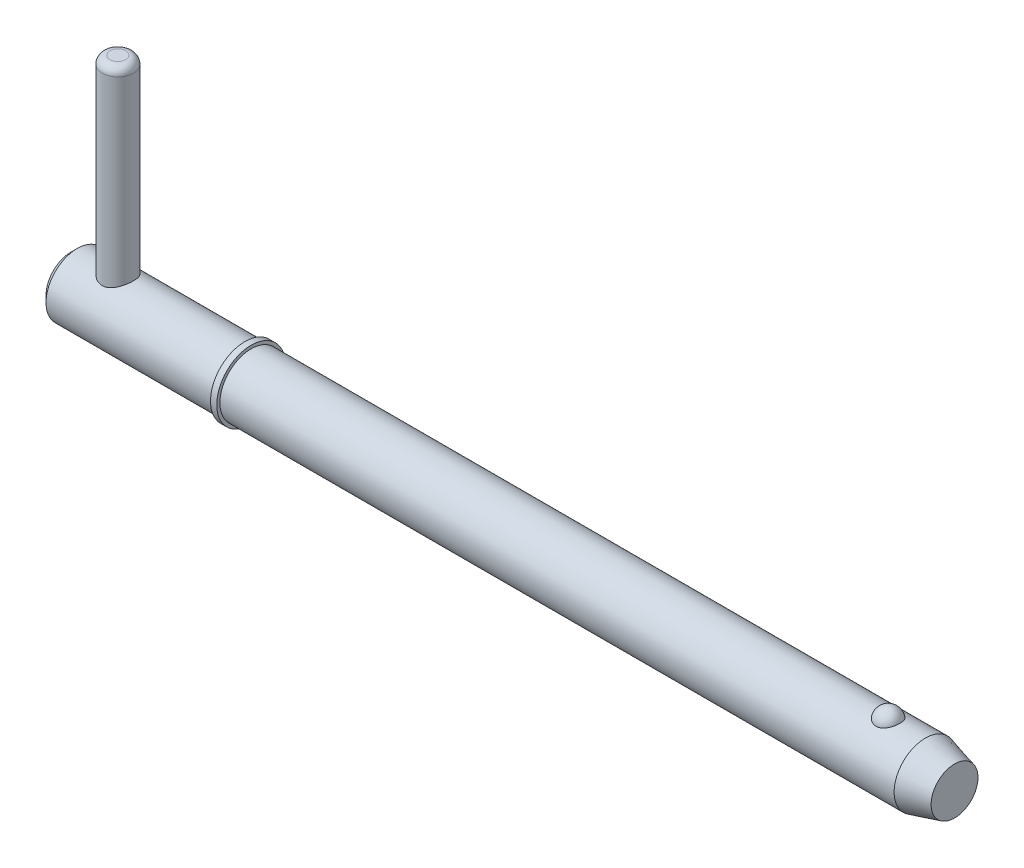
ISO-10303-21;
HEADER;
FILE_DESCRIPTION(('STEP AP214'),'2;1');
FILE_NAME('part.step','',(''),(''),'','','');
FILE_SCHEMA(('AUTOMOTIVE_DESIGN { 1 0 10303 214 1 1 1 1 }'));
ENDSEC;
DATA;
#1=APPLICATION_CONTEXT('core data for automotive mechanical design processes');
#2=APPLICATION_PROTOCOL_DEFINITION('international standard','automotive_design',2000,#1);
#3=PRODUCT_CONTEXT('',#1,'mechanical');
#4=PRODUCT('Part','Part','',(#3));
#5=PRODUCT_RELATED_PRODUCT_CATEGORY('part','',(#4));
#6=PRODUCT_DEFINITION_FORMATION('','',#4);
#7=PRODUCT_DEFINITION_CONTEXT('part definition',#1,'design');
#8=PRODUCT_DEFINITION('design','',#6,#7);
#9=PRODUCT_DEFINITION_SHAPE('','',#8);
#10=(LENGTH_UNIT() NAMED_UNIT(*) SI_UNIT(.MILLI.,.METRE.));
#11=(NAMED_UNIT(*) PLANE_ANGLE_UNIT() SI_UNIT($,.RADIAN.));
#12=(NAMED_UNIT(*) SI_UNIT($,.STERADIAN.) SOLID_ANGLE_UNIT());
#13=UNCERTAINTY_MEASURE_WITH_UNIT(LENGTH_MEASURE(1.E-05),#10,'distance_accuracy_value','');
#14=(GEOMETRIC_REPRESENTATION_CONTEXT(3) GLOBAL_UNCERTAINTY_ASSIGNED_CONTEXT((#13)) GLOBAL_UNIT_ASSIGNED_CONTEXT((#10,
#11,#12)) REPRESENTATION_CONTEXT('',''));
#15=CARTESIAN_POINT('',(0.,0.,0.));
#16=DIRECTION('',(0.,0.,1.));
#17=DIRECTION('',(1.,0.,0.));
#18=AXIS2_PLACEMENT_3D('',#15,#16,#17);
#19=CARTESIAN_POINT('',(4.755,22.225,0.));
#20=DIRECTION('',(0.,-1.,0.));
#21=DIRECTION('',(0.,0.,-1.));
#22=AXIS2_PLACEMENT_3D('',#19,#20,#21);
#23=CYLINDRICAL_SURFACE('',#22,1.585);
#24=CARTESIAN_POINT('',(4.755,-2.3825,0.));
#25=DIRECTION('',(0.,1.,0.));
#26=DIRECTION('',(0.,0.,1.));
#27=AXIS2_PLACEMENT_3D('',#24,#25,#26);
#28=CIRCLE('',#27,1.585);
#29=CARTESIAN_POINT('',(4.755,-2.3825,1.585));
#30=VERTEX_POINT('',#29);
#31=EDGE_CURVE('P0_E25',#30,#30,#28,.T.);
#32=ORIENTED_EDGE('',*,*,#31,.T.);
#33=EDGE_LOOP('',(#32));
#34=FACE_BOUND('',#33,.T.);
#35=CARTESIAN_POINT('',(4.755,21.4325,0.));
#36=DIRECTION('',(0.,1.,0.));
#37=DIRECTION('',(0.,0.,1.));
#38=AXIS2_PLACEMENT_3D('',#35,#36,#37);
#39=CIRCLE('',#38,1.585);
#40=CARTESIAN_POINT('',(4.755,21.4325,1.585));
#41=VERTEX_POINT('',#40);
#42=EDGE_CURVE('P0_E29',#41,#41,#39,.F.);
#43=ORIENTED_EDGE('',*,*,#42,.T.);
#44=EDGE_LOOP('',(#43));
#45=FACE_BOUND('',#44,.T.);
#46=ADVANCED_FACE('P0_F14',(#34,#45),#23,.T.);
#47=CARTESIAN_POINT('',(4.755,22.225,0.));
#48=DIRECTION('',(0.,1.,0.));
#49=DIRECTION('',(0.,0.,1.));
#50=AXIS2_PLACEMENT_3D('',#47,#48,#49);
#51=PLANE('',#50);
#52=CARTESIAN_POINT('',(4.755,22.225,0.));
#53=DIRECTION('',(0.,1.,0.));
#54=DIRECTION('',(0.,0.,1.));
#55=AXIS2_PLACEMENT_3D('',#52,#53,#54);
#56=CIRCLE('',#55,0.7925);
#57=CARTESIAN_POINT('',(4.755,22.225,0.7925));
#58=VERTEX_POINT('',#57);
#59=EDGE_CURVE('P0_E10',#58,#58,#56,.T.);
#60=ORIENTED_EDGE('',*,*,#59,.T.);
#61=EDGE_LOOP('',(#60));
#62=FACE_BOUND('',#61,.T.);
#63=ADVANCED_FACE('P0_F46',(#62),#51,.T.);
#64=CARTESIAN_POINT('',(4.755,-3.175,0.));
#65=DIRECTION('',(0.,1.,0.));
#66=DIRECTION('',(0.,0.,1.));
#67=AXIS2_PLACEMENT_3D('',#64,#65,#66);
#68=PLANE('',#67);
#69=CARTESIAN_POINT('',(4.755,-3.175,0.));
#70=DIRECTION('',(0.,1.,0.));
#71=DIRECTION('',(0.,0.,1.));
#72=AXIS2_PLACEMENT_3D('',#69,#70,#71);
#73=CIRCLE('',#72,0.7925);
#74=CARTESIAN_POINT('',(4.755,-3.175,0.7925));
#75=VERTEX_POINT('',#74);
#76=EDGE_CURVE('P0_E21',#75,#75,#73,.F.);
#77=ORIENTED_EDGE('',*,*,#76,.T.);
#78=EDGE_LOOP('',(#77));
#79=FACE_BOUND('',#78,.T.);
#80=ADVANCED_FACE('P0_F43',(#79),#68,.F.);
#81=CARTESIAN_POINT('',(4.755,-2.3825,0.));
#82=DIRECTION('',(0.,1.,0.));
#83=DIRECTION('',(0.,0.,1.));
#84=AXIS2_PLACEMENT_3D('',#81,#82,#83);
#85=DEGENERATE_TOROIDAL_SURFACE('',#84,0.7925,0.7925,.T.);
#86=ORIENTED_EDGE('',*,*,#76,.F.);
#87=EDGE_LOOP('',(#86));
#88=FACE_BOUND('',#87,.T.);
#89=ORIENTED_EDGE('',*,*,#31,.F.);
#90=EDGE_LOOP('',(#89));
#91=FACE_BOUND('',#90,.T.);
#92=ADVANCED_FACE('P0_F38',(#88,#91),#85,.T.);
#93=CARTESIAN_POINT('',(4.755,21.4325,0.));
#94=DIRECTION('',(0.,1.,0.));
#95=DIRECTION('',(0.,0.,1.));
#96=AXIS2_PLACEMENT_3D('',#93,#94,#95);
#97=DEGENERATE_TOROIDAL_SURFACE('',#96,0.7925,0.7925,.T.);
#98=ORIENTED_EDGE('',*,*,#42,.F.);
#99=EDGE_LOOP('',(#98));
#100=FACE_BOUND('',#99,.T.);
#101=ORIENTED_EDGE('',*,*,#59,.F.);
#102=EDGE_LOOP('',(#101));
#103=FACE_BOUND('',#102,.T.);
#104=ADVANCED_FACE('P0_F16',(#100,#103),#97,.T.);
#105=CLOSED_SHELL('',(#46,#63,#80,#92,#104));
#106=MANIFOLD_SOLID_BREP('P0_B1',#105);
#107=CARTESIAN_POINT('',(0.,0.,0.));
#108=DIRECTION('',(1.,0.,0.));
#109=DIRECTION('',(0.,0.,-1.));
#110=AXIS2_PLACEMENT_3D('',#107,#108,#109);
#111=CYLINDRICAL_SURFACE('',#110,3.175);
#112=CARTESIAN_POINT('',(86.7476846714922,0.,0.));
#113=DIRECTION('',(1.,0.,0.));
#114=DIRECTION('',(0.,0.,-1.));
#115=AXIS2_PLACEMENT_3D('',#112,#113,#114);
#116=CIRCLE('',#115,3.175);
#117=CARTESIAN_POINT('',(86.7476846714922,0.,-3.175));
#118=VERTEX_POINT('',#117);
#119=EDGE_CURVE('P1_E81',#118,#118,#116,.T.);
#120=ORIENTED_EDGE('',*,*,#119,.F.);
#121=EDGE_LOOP('',(#120));
#122=FACE_BOUND('',#121,.T.);
#123=CARTESIAN_POINT('',(18.29,0.,0.));
#124=DIRECTION('',(1.,0.,0.));
#125=DIRECTION('',(0.,0.,-1.));
#126=AXIS2_PLACEMENT_3D('',#123,#124,#125);
#127=CIRCLE('',#126,3.175);
#128=CARTESIAN_POINT('',(18.29,0.,-3.175));
#129=VERTEX_POINT('',#128);
#130=EDGE_CURVE('P1_E85',#129,#129,#127,.T.);
#131=ORIENTED_EDGE('',*,*,#130,.T.);
#132=EDGE_LOOP('',(#131));
#133=FACE_BOUND('',#132,.T.);
#134=CARTESIAN_POINT('',(82.9757276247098,2.92898950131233,1.2254164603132));
#135=CARTESIAN_POINT('',(82.912316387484,2.92899434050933,1.22541146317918));
#136=CARTESIAN_POINT('',(82.8487979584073,2.93112688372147,1.2203464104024));
#137=CARTESIAN_POINT('',(82.7235306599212,2.93942752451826,1.20020949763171));
#138=CARTESIAN_POINT('',(82.6617869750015,2.9456063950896,1.1851109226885));
#139=CARTESIAN_POINT('',(82.5420651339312,2.96127115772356,1.14540352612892));
#140=CARTESIAN_POINT('',(82.4840775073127,2.97074831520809,1.12081980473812));
#141=CARTESIAN_POINT('',(82.3731943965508,2.99197584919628,1.06285154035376));
#142=CARTESIAN_POINT('',(82.3202966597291,3.0037252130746,1.02947091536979));
#143=CARTESIAN_POINT('',(82.2192688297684,3.02865714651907,0.953674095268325));
#144=CARTESIAN_POINT('',(82.171324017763,3.04187163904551,0.911021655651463));
#145=CARTESIAN_POINT('',(82.0830360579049,3.06808741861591,0.818400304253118));
#146=CARTESIAN_POINT('',(82.0426952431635,3.08108863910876,0.768429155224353));
#147=CARTESIAN_POINT('',(81.9688039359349,3.10614903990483,0.660064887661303));
#148=CARTESIAN_POINT('',(81.9356330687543,3.11814104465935,0.601396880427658));
#149=CARTESIAN_POINT('',(81.8791190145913,3.13926931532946,0.479026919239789));
#150=CARTESIAN_POINT('',(81.8557764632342,3.14840539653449,0.415324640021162));
#151=CARTESIAN_POINT('',(81.8191785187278,3.16298160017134,0.283885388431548));
#152=CARTESIAN_POINT('',(81.8060407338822,3.16837855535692,0.216110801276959));
#153=CARTESIAN_POINT('',(81.7905676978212,3.17475386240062,0.0791367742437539));
#154=CARTESIAN_POINT('',(81.788232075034,3.17573236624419,0.00993738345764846));
#155=CARTESIAN_POINT('',(81.794388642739,3.17318075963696,-0.127420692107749));
#156=CARTESIAN_POINT('',(81.8028073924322,3.16968122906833,-0.19558325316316));
#157=CARTESIAN_POINT('',(81.8301752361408,3.1585790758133,-0.329413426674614));
#158=CARTESIAN_POINT('',(81.8491245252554,3.15097637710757,-0.395080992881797));
#159=CARTESIAN_POINT('',(81.8972057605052,3.13242485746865,-0.5221806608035));
#160=CARTESIAN_POINT('',(81.9263524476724,3.12147119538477,-0.583606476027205));
#161=CARTESIAN_POINT('',(81.9942352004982,3.09734973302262,-0.700436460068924));
#162=CARTESIAN_POINT('',(82.032972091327,3.08418174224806,-0.755840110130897));
#163=CARTESIAN_POINT('',(82.1194771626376,3.05694884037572,-0.859404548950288));
#164=CARTESIAN_POINT('',(82.1672961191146,3.04287919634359,-0.907521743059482));
#165=CARTESIAN_POINT('',(82.2707353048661,3.01548927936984,-0.994758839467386));
#166=CARTESIAN_POINT('',(82.3263549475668,3.0021689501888,-1.03387941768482));
#167=CARTESIAN_POINT('',(82.4428093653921,2.97810316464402,-1.10126594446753));
#168=CARTESIAN_POINT('',(82.5035182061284,2.96731170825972,-1.12973256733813));
#169=CARTESIAN_POINT('',(82.6293712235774,2.94928934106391,-1.17598467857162));
#170=CARTESIAN_POINT('',(82.6945137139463,2.94205708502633,-1.19377420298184));
#171=CARTESIAN_POINT('',(82.8238562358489,2.93233065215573,-1.21746387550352));
#172=CARTESIAN_POINT('',(82.8879385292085,2.92961621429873,-1.22391763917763));
#173=CARTESIAN_POINT('',(83.0163375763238,2.92855752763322,-1.22644976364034));
#174=CARTESIAN_POINT('',(83.0806542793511,2.93021238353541,-1.22253024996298));
#175=CARTESIAN_POINT('',(83.2055239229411,2.9375685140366,-1.20474140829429));
#176=CARTESIAN_POINT('',(83.266131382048,2.94313790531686,-1.19119621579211));
#177=CARTESIAN_POINT('',(83.3841106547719,2.95756226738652,-1.15491492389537));
#178=CARTESIAN_POINT('',(83.4414822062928,2.96641750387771,-1.13217808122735));
#179=CARTESIAN_POINT('',(83.5527699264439,2.98669918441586,-1.07755083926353));
#180=CARTESIAN_POINT('',(83.6065845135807,2.9981771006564,-1.0454730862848));
#181=CARTESIAN_POINT('',(83.7081473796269,3.02240235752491,-0.97322030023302));
#182=CARTESIAN_POINT('',(83.7558942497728,3.03514999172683,-0.933043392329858));
#183=CARTESIAN_POINT('',(83.8465817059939,3.06131230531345,-0.843372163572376));
#184=CARTESIAN_POINT('',(83.8891588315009,3.07472822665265,-0.793510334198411));
#185=CARTESIAN_POINT('',(83.9656765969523,3.10021106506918,-0.687241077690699));
#186=CARTESIAN_POINT('',(83.9996156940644,3.1122777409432,-0.630832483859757));
#187=CARTESIAN_POINT('',(84.0591209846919,3.134208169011,-0.51105938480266));
#188=CARTESIAN_POINT('',(84.0843892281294,3.14399040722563,-0.447531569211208));
#189=CARTESIAN_POINT('',(84.1245117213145,3.15983820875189,-0.31682749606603));
#190=CARTESIAN_POINT('',(84.1393659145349,3.16590375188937,-0.249651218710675));
#191=CARTESIAN_POINT('',(84.158358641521,3.17370076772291,-0.113549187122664));
#192=CARTESIAN_POINT('',(84.1624966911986,3.17543204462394,-0.0446233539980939));
#193=CARTESIAN_POINT('',(84.1599697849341,3.17438372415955,0.0929938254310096));
#194=CARTESIAN_POINT('',(84.1533050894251,3.17160423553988,0.16168517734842));
#195=CARTESIAN_POINT('',(84.1293754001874,3.1618438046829,0.296502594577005));
#196=CARTESIAN_POINT('',(84.1121674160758,3.15488546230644,0.362640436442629));
#197=CARTESIAN_POINT('',(84.067547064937,3.13748892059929,0.490896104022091));
#198=CARTESIAN_POINT('',(84.0401339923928,3.12705048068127,0.553013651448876));
#199=CARTESIAN_POINT('',(83.9754626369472,3.10369139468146,0.671876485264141));
#200=CARTESIAN_POINT('',(83.9381467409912,3.0907563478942,0.728587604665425));
#201=CARTESIAN_POINT('',(83.8545246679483,3.06381731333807,0.834653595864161));
#202=CARTESIAN_POINT('',(83.8082189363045,3.04981337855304,0.884008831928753));
#203=CARTESIAN_POINT('',(83.707718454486,3.02230423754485,0.973916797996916));
#204=CARTESIAN_POINT('',(83.653535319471,3.00879833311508,1.01448227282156));
#205=CARTESIAN_POINT('',(83.5385299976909,2.98383625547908,1.0857155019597));
#206=CARTESIAN_POINT('',(83.4777053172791,2.9723808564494,1.11637952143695));
#207=CARTESIAN_POINT('',(83.3533690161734,2.95329063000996,1.16592590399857));
#208=CARTESIAN_POINT('',(83.2900230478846,2.9455373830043,1.18517901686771));
#209=CARTESIAN_POINT('',(83.1607664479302,2.9342556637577,1.21284802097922));
#210=CARTESIAN_POINT('',(83.0948641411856,2.93071450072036,1.2212964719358));
#211=CARTESIAN_POINT('',(83.011116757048,2.9291525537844,1.22502505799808));
#212=CARTESIAN_POINT('',(82.9934263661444,2.92898815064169,1.22541785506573));
#213=CARTESIAN_POINT('',(82.9757276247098,2.92898950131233,1.2254164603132));
#214=B_SPLINE_CURVE_WITH_KNOTS('',3,(#134,#135,#136,#137,#138,#139,#140,#141,#142,#143,#144,
#145,#146,#147,#148,#149,#150,#151,#152,#153,#154,#155,#156,#157,#158,#159,#160,#161,#162,#163,
#164,#165,#166,#167,#168,#169,#170,#171,#172,#173,#174,#175,#176,#177,#178,#179,#180,#181,#182,
#183,#184,#185,#186,#187,#188,#189,#190,#191,#192,#193,#194,#195,#196,#197,#198,#199,#200,#201,
#202,#203,#204,#205,#206,#207,#208,#209,#210,#211,#212,#213),.UNSPECIFIED.,.T.,.F.,(4,2,2,2,2,2,
2,2,2,2,2,2,2,2,2,2,2,2,2,2,2,2,2,2,2,2,2,2,2,2,2,2,2,2,2,2,2,2,2,4),(0.,0.190186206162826,
0.380880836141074,0.571074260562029,0.761183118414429,0.956866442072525,1.15260970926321,
1.3570177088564,1.56143892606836,1.76818248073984,1.97491892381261,2.18025109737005,
2.38558707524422,2.59122111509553,2.79687285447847,3.00371012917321,3.2105318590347,
3.41323429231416,3.61586005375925,3.80828192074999,4.00066436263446,4.18685798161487,
4.37306665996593,4.56330302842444,4.75358348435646,4.95345287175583,5.15335793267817,
5.35957003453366,5.56578325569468,5.7720057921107,5.97822335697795,6.183335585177,
6.38846199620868,6.59480900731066,6.80114579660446,7.00718137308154,7.21329457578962,
7.41228022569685,7.61066481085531,7.66374777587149),.UNSPECIFIED.);
#215=CARTESIAN_POINT('',(82.9757276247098,2.92898950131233,1.2254164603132));
#216=VERTEX_POINT('',#215);
#217=EDGE_CURVE('P1_E35',#216,#216,#214,.T.);
#218=ORIENTED_EDGE('',*,*,#217,.T.);
#219=EDGE_LOOP('',(#218));
#220=FACE_BOUND('',#219,.T.);
#221=ADVANCED_FACE('P1_F13',(#122,#133,#220),#111,.T.);
#222=CARTESIAN_POINT('',(0.,0.,0.));
#223=DIRECTION('',(-1.,0.,0.));
#224=DIRECTION('',(0.,0.,1.));
#225=AXIS2_PLACEMENT_3D('',#222,#223,#224);
#226=PLANE('',#225);
#227=CARTESIAN_POINT('',(0.,0.,0.));
#228=DIRECTION('',(1.,0.,0.));
#229=DIRECTION('',(0.,0.,-1.));
#230=AXIS2_PLACEMENT_3D('',#227,#228,#229);
#231=CIRCLE('',#230,2.54);
#232=CARTESIAN_POINT('',(0.,0.,-2.54));
#233=VERTEX_POINT('',#232);
#234=EDGE_CURVE('P1_E9',#233,#233,#231,.T.);
#235=ORIENTED_EDGE('',*,*,#234,.F.);
#236=EDGE_LOOP('',(#235));
#237=FACE_BOUND('',#236,.T.);
#238=ADVANCED_FACE('P1_F15',(#237),#226,.T.);
#239=CARTESIAN_POINT('',(0.634999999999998,0.,0.));
#240=DIRECTION('',(1.,0.,0.));
#241=DIRECTION('',(0.,0.,-1.));
#242=AXIS2_PLACEMENT_3D('',#239,#240,#241);
#243=CONICAL_SURFACE('',#242,3.175,0.78539816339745);
#244=ORIENTED_EDGE('',*,*,#234,.T.);
#245=EDGE_LOOP('',(#244));
#246=FACE_BOUND('',#245,.T.);
#247=CARTESIAN_POINT('',(0.634999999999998,0.,0.));
#248=DIRECTION('',(1.,0.,0.));
#249=DIRECTION('',(0.,0.,-1.));
#250=AXIS2_PLACEMENT_3D('',#247,#248,#249);
#251=CIRCLE('',#250,3.175);
#252=CARTESIAN_POINT('',(0.634999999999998,0.,-3.175));
#253=VERTEX_POINT('',#252);
#254=EDGE_CURVE('P1_E26',#253,#253,#251,.T.);
#255=ORIENTED_EDGE('',*,*,#254,.F.);
#256=EDGE_LOOP('',(#255));
#257=FACE_BOUND('',#256,.T.);
#258=ADVANCED_FACE('P1_F77',(#246,#257),#243,.T.);
#259=CARTESIAN_POINT('',(0.,0.,0.));
#260=DIRECTION('',(1.,0.,0.));
#261=DIRECTION('',(0.,0.,-1.));
#262=AXIS2_PLACEMENT_3D('',#259,#260,#261);
#263=CYLINDRICAL_SURFACE('',#262,3.175);
#264=CARTESIAN_POINT('',(4.755,-2.75107251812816,1.585));
#265=CARTESIAN_POINT('',(4.67238891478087,-2.7510796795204,1.58499425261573));
#266=CARTESIAN_POINT('',(4.58967306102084,-2.75485010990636,1.57849830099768));
#267=CARTESIAN_POINT('',(4.42677850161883,-2.76938647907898,1.55284486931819));
#268=CARTESIAN_POINT('',(4.34660551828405,-2.78016716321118,1.53366069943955));
#269=CARTESIAN_POINT('',(4.19146029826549,-2.80716278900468,1.48366329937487));
#270=CARTESIAN_POINT('',(4.11646293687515,-2.8233488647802,1.45291173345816));
#271=CARTESIAN_POINT('',(3.97271079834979,-2.85928672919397,1.38084067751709));
#272=CARTESIAN_POINT('',(3.90395634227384,-2.87903870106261,1.33952064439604));
#273=CARTESIAN_POINT('',(3.76839976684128,-2.921867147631,1.24350234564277));
#274=CARTESIAN_POINT('',(3.702222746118,-2.94508343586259,1.18798355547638));
#275=CARTESIAN_POINT('',(3.5796334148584,-2.99109588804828,1.06685014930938));
#276=CARTESIAN_POINT('',(3.52322596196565,-3.01389183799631,1.00123054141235));
#277=CARTESIAN_POINT('',(3.41807024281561,-3.05832598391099,0.856373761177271));
#278=CARTESIAN_POINT('',(3.37009053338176,-3.07978367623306,0.776518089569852));
#279=CARTESIAN_POINT('',(3.28853137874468,-3.11730894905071,0.608596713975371));
#280=CARTESIAN_POINT('',(3.25494287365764,-3.1333799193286,0.520536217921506));
#281=CARTESIAN_POINT('',(3.20559401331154,-3.15731341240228,0.345327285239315));
#282=CARTESIAN_POINT('',(3.18873760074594,-3.16567752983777,0.258557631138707));
#283=CARTESIAN_POINT('',(3.16972238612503,-3.17512718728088,0.0830496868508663));
#284=CARTESIAN_POINT('',(3.16755472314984,-3.17621711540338,-0.00568738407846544));
#285=CARTESIAN_POINT('',(3.1775542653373,-3.17123385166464,-0.174372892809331));
#286=CARTESIAN_POINT('',(3.18849502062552,-3.16577346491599,-0.254416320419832));
#287=CARTESIAN_POINT('',(3.22220680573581,-3.14922844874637,-0.411354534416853));
#288=CARTESIAN_POINT('',(3.2449787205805,-3.13814339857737,-0.488249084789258));
#289=CARTESIAN_POINT('',(3.30185558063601,-3.111172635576,-0.638050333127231));
#290=CARTESIAN_POINT('',(3.33611332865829,-3.09522247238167,-0.710886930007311));
#291=CARTESIAN_POINT('',(3.41477890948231,-3.05996035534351,-0.849953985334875));
#292=CARTESIAN_POINT('',(3.45919037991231,-3.04064719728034,-0.916182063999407));
#293=CARTESIAN_POINT('',(3.5617148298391,-2.99832415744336,-1.04681642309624));
#294=CARTESIAN_POINT('',(3.62072497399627,-2.97513741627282,-1.11046186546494));
#295=CARTESIAN_POINT('',(3.7483697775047,-2.92885066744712,-1.22736291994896));
#296=CARTESIAN_POINT('',(3.81701173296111,-2.90575073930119,-1.2806105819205));
#297=CARTESIAN_POINT('',(3.96727993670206,-2.86067370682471,-1.37849835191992));
#298=CARTESIAN_POINT('',(4.04945242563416,-2.83885964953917,-1.42238246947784));
#299=CARTESIAN_POINT('',(4.2213558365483,-2.80110454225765,-1.49537418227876));
#300=CARTESIAN_POINT('',(4.3110787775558,-2.78515738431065,-1.52449715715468));
#301=CARTESIAN_POINT('',(4.48806324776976,-2.76271292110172,-1.56478065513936));
#302=CARTESIAN_POINT('',(4.57495732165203,-2.75556745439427,-1.57718067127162));
#303=CARTESIAN_POINT('',(4.74985771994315,-2.74969306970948,-1.58740564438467));
#304=CARTESIAN_POINT('',(4.8378632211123,-2.75095824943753,-1.58524082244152));
#305=CARTESIAN_POINT('',(5.00227282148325,-2.76107477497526,-1.56753530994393));
#306=CARTESIAN_POINT('',(5.07889680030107,-2.76908515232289,-1.55347662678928));
#307=CARTESIAN_POINT('',(5.22855309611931,-2.79054849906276,-1.51458035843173));
#308=CARTESIAN_POINT('',(5.30158424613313,-2.80400322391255,-1.489739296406));
#309=CARTESIAN_POINT('',(5.44583114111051,-2.83556995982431,-1.42877335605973));
#310=CARTESIAN_POINT('',(5.51680600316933,-2.85386886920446,-1.39217900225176));
#311=CARTESIAN_POINT('',(5.6520174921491,-2.89289503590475,-1.30915485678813));
#312=CARTESIAN_POINT('',(5.71625063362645,-2.91362353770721,-1.26272001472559));
#313=CARTESIAN_POINT('',(5.8445938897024,-2.95830220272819,-1.15451693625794));
#314=CARTESIAN_POINT('',(5.90767560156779,-2.98233004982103,-1.09155543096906));
#315=CARTESIAN_POINT('',(6.0226995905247,-3.02864458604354,-0.955560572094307));
#316=CARTESIAN_POINT('',(6.07463814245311,-3.05093069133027,-0.882523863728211));
#317=CARTESIAN_POINT('',(6.16704288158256,-3.09200671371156,-0.725836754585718));
#318=CARTESIAN_POINT('',(6.20717458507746,-3.11069030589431,-0.64195924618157));
#319=CARTESIAN_POINT('',(6.27235859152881,-3.1416474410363,-0.467442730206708));
#320=CARTESIAN_POINT('',(6.29742409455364,-3.15392659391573,-0.376809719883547));
#321=CARTESIAN_POINT('',(6.32960989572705,-3.16979844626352,-0.200314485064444));
#322=CARTESIAN_POINT('',(6.33816324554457,-3.17408359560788,-0.114775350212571));
#323=CARTESIAN_POINT('',(6.34130309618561,-3.17565001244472,0.0566108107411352));
#324=CARTESIAN_POINT('',(6.33589445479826,-3.17293371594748,0.142457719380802));
#325=CARTESIAN_POINT('',(6.31221457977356,-3.16120608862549,0.306097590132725));
#326=CARTESIAN_POINT('',(6.2948097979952,-3.15261910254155,0.38404960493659));
#327=CARTESIAN_POINT('',(6.24879775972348,-3.13040364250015,0.535801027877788));
#328=CARTESIAN_POINT('',(6.22018889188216,-3.11677444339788,0.609599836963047));
#329=CARTESIAN_POINT('',(6.15130303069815,-3.08497808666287,0.754502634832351));
#330=CARTESIAN_POINT('',(6.11057850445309,-3.0666414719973,0.82535556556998));
#331=CARTESIAN_POINT('',(6.01917980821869,-3.02735012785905,0.95951596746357));
#332=CARTESIAN_POINT('',(5.96850106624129,-3.00639419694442,1.02281994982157));
#333=CARTESIAN_POINT('',(5.8528006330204,-2.96149402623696,1.1467073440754));
#334=CARTESIAN_POINT('',(5.78685463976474,-2.93745961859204,1.20639723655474));
#335=CARTESIAN_POINT('',(5.64552278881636,-2.89084502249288,1.31419099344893));
#336=CARTESIAN_POINT('',(5.57012871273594,-2.8682661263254,1.36228466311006));
#337=CARTESIAN_POINT('',(5.40892145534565,-2.82661780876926,1.44677201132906));
#338=CARTESIAN_POINT('',(5.32285703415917,-2.80767948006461,1.48275497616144));
#339=CARTESIAN_POINT('',(5.14469010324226,-2.77716572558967,1.53916557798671));
#340=CARTESIAN_POINT('',(5.05260892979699,-2.76556569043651,1.55964525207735));
#341=CARTESIAN_POINT('',(4.92544162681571,-2.75613775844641,1.57618070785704));
#342=CARTESIAN_POINT('',(4.89147210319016,-2.75424493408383,1.57948285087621));
#343=CARTESIAN_POINT('',(4.82334103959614,-2.75171079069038,1.58389375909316));
#344=CARTESIAN_POINT('',(4.78917948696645,-2.75106955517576,1.58500237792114));
#345=CARTESIAN_POINT('',(4.755,-2.75107251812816,1.585));
#346=B_SPLINE_CURVE_WITH_KNOTS('',3,(#264,#265,#266,#267,#268,#269,#270,#271,#272,#273,#274,
#275,#276,#277,#278,#279,#280,#281,#282,#283,#284,#285,#286,#287,#288,#289,#290,#291,#292,#293,
#294,#295,#296,#297,#298,#299,#300,#301,#302,#303,#304,#305,#306,#307,#308,#309,#310,#311,#312,
#313,#314,#315,#316,#317,#318,#319,#320,#321,#322,#323,#324,#325,#326,#327,#328,#329,#330,#331,
#332,#333,#334,#335,#336,#337,#338,#339,#340,#341,#342,#343,#344,#345),.UNSPECIFIED.,.T.,.F.,(4,
2,2,2,2,2,2,2,2,2,2,2,2,2,2,2,2,2,2,2,2,2,2,2,2,2,2,2,2,2,2,2,2,2,2,2,2,2,2,2,4),(0.,
0.247689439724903,0.495901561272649,0.742808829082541,0.989728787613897,1.25694656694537,
1.52429683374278,1.80959781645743,2.0947189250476,2.35960564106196,2.62433255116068,
2.86610932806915,3.1079041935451,3.35305262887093,3.59828902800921,3.86665310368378,
4.13522157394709,4.4207514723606,4.70598326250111,4.9686344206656,5.23110127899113,
5.46499114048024,5.69895647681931,5.94376186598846,6.1886932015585,6.46438263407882,
6.74016408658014,7.0231370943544,7.30586181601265,7.5626977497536,7.81944433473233,
8.05935987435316,8.29930993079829,8.54954401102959,8.79989329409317,9.07508848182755,
9.35052473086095,9.63453318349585,9.91758407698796,10.0200561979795,10.1225351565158),.UNSPECIFIED.);
#347=CARTESIAN_POINT('',(4.755,-2.75107251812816,1.585));
#348=VERTEX_POINT('',#347);
#349=EDGE_CURVE('P1_E17',#348,#348,#346,.T.);
#350=ORIENTED_EDGE('',*,*,#349,.F.);
#351=EDGE_LOOP('',(#350));
#352=FACE_BOUND('',#351,.T.);
#353=CARTESIAN_POINT('',(4.755,2.75107251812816,1.585));
#354=CARTESIAN_POINT('',(4.83761108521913,2.7510796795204,1.58499425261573));
#355=CARTESIAN_POINT('',(4.92032693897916,2.75485010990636,1.57849830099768));
#356=CARTESIAN_POINT('',(5.08322149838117,2.76938647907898,1.55284486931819));
#357=CARTESIAN_POINT('',(5.16339448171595,2.78016716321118,1.53366069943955));
#358=CARTESIAN_POINT('',(5.31853970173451,2.80716278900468,1.48366329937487));
#359=CARTESIAN_POINT('',(5.39353706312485,2.8233488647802,1.45291173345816));
#360=CARTESIAN_POINT('',(5.53728920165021,2.85928672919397,1.38084067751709));
#361=CARTESIAN_POINT('',(5.60604365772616,2.87903870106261,1.33952064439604));
#362=CARTESIAN_POINT('',(5.74160023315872,2.921867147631,1.24350234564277));
#363=CARTESIAN_POINT('',(5.807777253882,2.94508343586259,1.18798355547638));
#364=CARTESIAN_POINT('',(5.9303665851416,2.99109588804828,1.06685014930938));
#365=CARTESIAN_POINT('',(5.98677403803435,3.01389183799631,1.00123054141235));
#366=CARTESIAN_POINT('',(6.09192975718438,3.05832598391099,0.85637376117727));
#367=CARTESIAN_POINT('',(6.13990946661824,3.07978367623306,0.776518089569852));
#368=CARTESIAN_POINT('',(6.22146862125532,3.11730894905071,0.608596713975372));
#369=CARTESIAN_POINT('',(6.25505712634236,3.1333799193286,0.520536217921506));
#370=CARTESIAN_POINT('',(6.30440598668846,3.15731341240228,0.345327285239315));
#371=CARTESIAN_POINT('',(6.32126239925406,3.16567752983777,0.258557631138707));
#372=CARTESIAN_POINT('',(6.34027761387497,3.17512718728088,0.0830496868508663));
#373=CARTESIAN_POINT('',(6.34244527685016,3.17621711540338,-0.00568738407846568));
#374=CARTESIAN_POINT('',(6.3324457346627,3.17123385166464,-0.174372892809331));
#375=CARTESIAN_POINT('',(6.32150497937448,3.16577346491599,-0.254416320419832));
#376=CARTESIAN_POINT('',(6.28779319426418,3.14922844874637,-0.411354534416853));
#377=CARTESIAN_POINT('',(6.2650212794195,3.13814339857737,-0.488249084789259));
#378=CARTESIAN_POINT('',(6.20814441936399,3.111172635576,-0.638050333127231));
#379=CARTESIAN_POINT('',(6.17388667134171,3.09522247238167,-0.710886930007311));
#380=CARTESIAN_POINT('',(6.09522109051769,3.05996035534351,-0.849953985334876));
#381=CARTESIAN_POINT('',(6.05080962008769,3.04064719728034,-0.916182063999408));
#382=CARTESIAN_POINT('',(5.9482851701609,2.99832415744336,-1.04681642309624));
#383=CARTESIAN_POINT('',(5.88927502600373,2.97513741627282,-1.11046186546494));
#384=CARTESIAN_POINT('',(5.7616302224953,2.92885066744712,-1.22736291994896));
#385=CARTESIAN_POINT('',(5.69298826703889,2.90575073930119,-1.2806105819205));
#386=CARTESIAN_POINT('',(5.54272006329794,2.86067370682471,-1.37849835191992));
#387=CARTESIAN_POINT('',(5.46054757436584,2.83885964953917,-1.42238246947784));
#388=CARTESIAN_POINT('',(5.2886441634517,2.80110454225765,-1.49537418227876));
#389=CARTESIAN_POINT('',(5.19892122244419,2.78515738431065,-1.52449715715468));
#390=CARTESIAN_POINT('',(5.02193675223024,2.76271292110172,-1.56478065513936));
#391=CARTESIAN_POINT('',(4.93504267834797,2.75556745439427,-1.57718067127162));
#392=CARTESIAN_POINT('',(4.76014228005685,2.74969306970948,-1.58740564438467));
#393=CARTESIAN_POINT('',(4.6721367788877,2.75095824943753,-1.58524082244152));
#394=CARTESIAN_POINT('',(4.50772717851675,2.76107477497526,-1.56753530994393));
#395=CARTESIAN_POINT('',(4.43110319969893,2.76908515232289,-1.55347662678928));
#396=CARTESIAN_POINT('',(4.28144690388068,2.79054849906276,-1.51458035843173));
#397=CARTESIAN_POINT('',(4.20841575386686,2.80400322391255,-1.489739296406));
#398=CARTESIAN_POINT('',(4.06416885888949,2.83556995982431,-1.42877335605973));
#399=CARTESIAN_POINT('',(3.99319399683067,2.85386886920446,-1.39217900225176));
#400=CARTESIAN_POINT('',(3.8579825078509,2.89289503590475,-1.30915485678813));
#401=CARTESIAN_POINT('',(3.79374936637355,2.91362353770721,-1.26272001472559));
#402=CARTESIAN_POINT('',(3.6654061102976,2.95830220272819,-1.15451693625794));
#403=CARTESIAN_POINT('',(3.60232439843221,2.98233004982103,-1.09155543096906));
#404=CARTESIAN_POINT('',(3.4873004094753,3.02864458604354,-0.955560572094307));
#405=CARTESIAN_POINT('',(3.43536185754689,3.05093069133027,-0.88252386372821));
#406=CARTESIAN_POINT('',(3.34295711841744,3.09200671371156,-0.725836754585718));
#407=CARTESIAN_POINT('',(3.30282541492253,3.11069030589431,-0.64195924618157));
#408=CARTESIAN_POINT('',(3.23764140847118,3.14164744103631,-0.467442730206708));
#409=CARTESIAN_POINT('',(3.21257590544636,3.15392659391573,-0.376809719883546));
#410=CARTESIAN_POINT('',(3.18039010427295,3.16979844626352,-0.200314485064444));
#411=CARTESIAN_POINT('',(3.17183675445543,3.17408359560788,-0.114775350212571));
#412=CARTESIAN_POINT('',(3.16869690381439,3.17565001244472,0.0566108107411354));
#413=CARTESIAN_POINT('',(3.17410554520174,3.17293371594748,0.142457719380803));
#414=CARTESIAN_POINT('',(3.19778542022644,3.16120608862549,0.306097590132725));
#415=CARTESIAN_POINT('',(3.2151902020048,3.15261910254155,0.384049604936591));
#416=CARTESIAN_POINT('',(3.26120224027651,3.13040364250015,0.535801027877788));
#417=CARTESIAN_POINT('',(3.28981110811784,3.11677444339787,0.609599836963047));
#418=CARTESIAN_POINT('',(3.35869696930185,3.08497808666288,0.754502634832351));
#419=CARTESIAN_POINT('',(3.39942149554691,3.0666414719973,0.82535556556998));
#420=CARTESIAN_POINT('',(3.49082019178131,3.02735012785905,0.95951596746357));
#421=CARTESIAN_POINT('',(3.54149893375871,3.00639419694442,1.02281994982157));
#422=CARTESIAN_POINT('',(3.6571993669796,2.96149402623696,1.1467073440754));
#423=CARTESIAN_POINT('',(3.72314536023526,2.93745961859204,1.20639723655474));
#424=CARTESIAN_POINT('',(3.86447721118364,2.89084502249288,1.31419099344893));
#425=CARTESIAN_POINT('',(3.93987128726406,2.8682661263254,1.36228466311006));
#426=CARTESIAN_POINT('',(4.10107854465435,2.82661780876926,1.44677201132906));
#427=CARTESIAN_POINT('',(4.18714296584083,2.80767948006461,1.48275497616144));
#428=CARTESIAN_POINT('',(4.36530989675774,2.77716572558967,1.53916557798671));
#429=CARTESIAN_POINT('',(4.45739107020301,2.76556569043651,1.55964525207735));
#430=CARTESIAN_POINT('',(4.58455837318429,2.75613775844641,1.57618070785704));
#431=CARTESIAN_POINT('',(4.61852789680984,2.75424493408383,1.57948285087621));
#432=CARTESIAN_POINT('',(4.68665896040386,2.75171079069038,1.58389375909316));
#433=CARTESIAN_POINT('',(4.72082051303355,2.75106955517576,1.58500237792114));
#434=CARTESIAN_POINT('',(4.755,2.75107251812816,1.585));
#435=B_SPLINE_CURVE_WITH_KNOTS('',3,(#353,#354,#355,#356,#357,#358,#359,#360,#361,#362,#363,
#364,#365,#366,#367,#368,#369,#370,#371,#372,#373,#374,#375,#376,#377,#378,#379,#380,#381,#382,
#383,#384,#385,#386,#387,#388,#389,#390,#391,#392,#393,#394,#395,#396,#397,#398,#399,#400,#401,
#402,#403,#404,#405,#406,#407,#408,#409,#410,#411,#412,#413,#414,#415,#416,#417,#418,#419,#420,
#421,#422,#423,#424,#425,#426,#427,#428,#429,#430,#431,#432,#433,#434),.UNSPECIFIED.,.T.,.F.,(4,
2,2,2,2,2,2,2,2,2,2,2,2,2,2,2,2,2,2,2,2,2,2,2,2,2,2,2,2,2,2,2,2,2,2,2,2,2,2,2,4),(0.,
0.247689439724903,0.495901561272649,0.742808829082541,0.989728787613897,1.25694656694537,
1.52429683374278,1.80959781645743,2.0947189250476,2.35960564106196,2.62433255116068,
2.86610932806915,3.1079041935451,3.35305262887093,3.59828902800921,3.86665310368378,
4.13522157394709,4.4207514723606,4.70598326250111,4.9686344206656,5.23110127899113,
5.46499114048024,5.69895647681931,5.94376186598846,6.1886932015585,6.46438263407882,
6.74016408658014,7.0231370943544,7.30586181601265,7.5626977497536,7.81944433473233,
8.05935987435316,8.29930993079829,8.54954401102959,8.79989329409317,9.07508848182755,
9.35052473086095,9.63453318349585,9.91758407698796,10.0200561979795,10.1225351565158),.UNSPECIFIED.);
#436=CARTESIAN_POINT('',(4.755,2.75107251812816,1.585));
#437=VERTEX_POINT('',#436);
#438=EDGE_CURVE('P1_E43',#437,#437,#435,.T.);
#439=ORIENTED_EDGE('',*,*,#438,.F.);
#440=EDGE_LOOP('',(#439));
#441=FACE_BOUND('',#440,.T.);
#442=ORIENTED_EDGE('',*,*,#254,.T.);
#443=EDGE_LOOP('',(#442));
#444=FACE_BOUND('',#443,.T.);
#445=CARTESIAN_POINT('',(17.655,0.,0.));
#446=DIRECTION('',(1.,0.,0.));
#447=DIRECTION('',(0.,0.,-1.));
#448=AXIS2_PLACEMENT_3D('',#445,#446,#447);
#449=CIRCLE('',#448,3.175);
#450=CARTESIAN_POINT('',(17.655,0.,-3.175));
#451=VERTEX_POINT('',#450);
#452=EDGE_CURVE('P1_E31',#451,#451,#449,.T.);
#453=ORIENTED_EDGE('',*,*,#452,.F.);
#454=EDGE_LOOP('',(#453));
#455=FACE_BOUND('',#454,.T.);
#456=ADVANCED_FACE('P1_F103',(#352,#441,#444,#455),#263,.T.);
#457=CARTESIAN_POINT('',(17.655,3.175,0.));
#458=DIRECTION('',(-1.,0.,0.));
#459=DIRECTION('',(0.,0.,1.));
#460=AXIS2_PLACEMENT_3D('',#457,#458,#459);
#461=PLANE('',#460);
#462=ORIENTED_EDGE('',*,*,#452,.T.);
#463=EDGE_LOOP('',(#462));
#464=FACE_BOUND('',#463,.T.);
#465=CARTESIAN_POINT('',(17.655,0.,0.));
#466=DIRECTION('',(1.,0.,0.));
#467=DIRECTION('',(0.,0.,-1.));
#468=AXIS2_PLACEMENT_3D('',#465,#466,#467);
#469=CIRCLE('',#468,3.4925);
#470=CARTESIAN_POINT('',(17.655,0.,-3.4925));
#471=VERTEX_POINT('',#470);
#472=EDGE_CURVE('P1_E91',#471,#471,#469,.T.);
#473=ORIENTED_EDGE('',*,*,#472,.F.);
#474=EDGE_LOOP('',(#473));
#475=FACE_BOUND('',#474,.T.);
#476=ADVANCED_FACE('P1_F100',(#464,#475),#461,.T.);
#477=CARTESIAN_POINT('',(0.,0.,0.));
#478=DIRECTION('',(1.,0.,0.));
#479=DIRECTION('',(0.,0.,-1.));
#480=AXIS2_PLACEMENT_3D('',#477,#478,#479);
#481=CYLINDRICAL_SURFACE('',#480,3.4925);
#482=ORIENTED_EDGE('',*,*,#472,.T.);
#483=EDGE_LOOP('',(#482));
#484=FACE_BOUND('',#483,.T.);
#485=CARTESIAN_POINT('',(18.29,0.,0.));
#486=DIRECTION('',(1.,0.,0.));
#487=DIRECTION('',(0.,0.,-1.));
#488=AXIS2_PLACEMENT_3D('',#485,#486,#487);
#489=CIRCLE('',#488,3.4925);
#490=CARTESIAN_POINT('',(18.29,0.,-3.4925));
#491=VERTEX_POINT('',#490);
#492=EDGE_CURVE('P1_E88',#491,#491,#489,.T.);
#493=ORIENTED_EDGE('',*,*,#492,.F.);
#494=EDGE_LOOP('',(#493));
#495=FACE_BOUND('',#494,.T.);
#496=ADVANCED_FACE('P1_F68',(#484,#495),#481,.T.);
#497=CARTESIAN_POINT('',(18.29,3.4925,0.));
#498=DIRECTION('',(1.,0.,0.));
#499=DIRECTION('',(0.,0.,-1.));
#500=AXIS2_PLACEMENT_3D('',#497,#498,#499);
#501=PLANE('',#500);
#502=ORIENTED_EDGE('',*,*,#492,.T.);
#503=EDGE_LOOP('',(#502));
#504=FACE_BOUND('',#503,.T.);
#505=ORIENTED_EDGE('',*,*,#130,.F.);
#506=EDGE_LOOP('',(#505));
#507=FACE_BOUND('',#506,.T.);
#508=ADVANCED_FACE('P1_F62',(#504,#507),#501,.T.);
#509=CARTESIAN_POINT('',(89.71,0.,0.));
#510=DIRECTION('',(-1.,0.,0.));
#511=DIRECTION('',(0.,0.,1.));
#512=AXIS2_PLACEMENT_3D('',#509,#510,#511);
#513=CONICAL_SURFACE('',#512,2.38125000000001,0.26179938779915);
#514=ORIENTED_EDGE('',*,*,#119,.T.);
#515=EDGE_LOOP('',(#514));
#516=FACE_BOUND('',#515,.T.);
#517=CARTESIAN_POINT('',(89.71,0.,0.));
#518=DIRECTION('',(1.,0.,0.));
#519=DIRECTION('',(0.,0.,-1.));
#520=AXIS2_PLACEMENT_3D('',#517,#518,#519);
#521=CIRCLE('',#520,2.38125000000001);
#522=CARTESIAN_POINT('',(89.71,0.,-2.38125000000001));
#523=VERTEX_POINT('',#522);
#524=EDGE_CURVE('P1_E42',#523,#523,#521,.T.);
#525=ORIENTED_EDGE('',*,*,#524,.F.);
#526=EDGE_LOOP('',(#525));
#527=FACE_BOUND('',#526,.T.);
#528=ADVANCED_FACE('P1_F59',(#516,#527),#513,.T.);
#529=CARTESIAN_POINT('',(89.71,2.38125000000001,0.));
#530=DIRECTION('',(1.,0.,0.));
#531=DIRECTION('',(0.,0.,-1.));
#532=AXIS2_PLACEMENT_3D('',#529,#530,#531);
#533=PLANE('',#532);
#534=ORIENTED_EDGE('',*,*,#524,.T.);
#535=EDGE_LOOP('',(#534));
#536=FACE_BOUND('',#535,.T.);
#537=ADVANCED_FACE('P1_F55',(#536),#533,.T.);
#538=CARTESIAN_POINT('',(82.9757276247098,2.8575,0.));
#539=DIRECTION('',(-1.,0.,0.));
#540=DIRECTION('',(0.,1.,0.));
#541=AXIS2_PLACEMENT_3D('',#538,#539,#540);
#542=SPHERICAL_SURFACE('',#541,1.22750000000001);
#543=ORIENTED_EDGE('',*,*,#217,.F.);
#544=EDGE_LOOP('',(#543));
#545=FACE_BOUND('',#544,.T.);
#546=ADVANCED_FACE('P1_F50',(#545),#542,.T.);
#547=CARTESIAN_POINT('',(4.755,-3.4925,0.));
#548=DIRECTION('',(0.,1.,0.));
#549=DIRECTION('',(0.,0.,1.));
#550=AXIS2_PLACEMENT_3D('',#547,#548,#549);
#551=CYLINDRICAL_SURFACE('',#550,1.585);
#552=ORIENTED_EDGE('',*,*,#349,.T.);
#553=EDGE_LOOP('',(#552));
#554=FACE_BOUND('',#553,.T.);
#555=ORIENTED_EDGE('',*,*,#438,.T.);
#556=EDGE_LOOP('',(#555));
#557=FACE_BOUND('',#556,.T.);
#558=ADVANCED_FACE('P1_F54',(#554,#557),#551,.F.);
#559=CLOSED_SHELL('',(#221,#238,#258,#456,#476,#496,#508,#528,#537,#546,#558));
#560=MANIFOLD_SOLID_BREP('P1_B1',#559);
#561=ADVANCED_BREP_SHAPE_REPRESENTATION('',(#18,#106,#560),#14);
#562=SHAPE_DEFINITION_REPRESENTATION(#9,#561);
ENDSEC;
END-ISO-10303-21;
